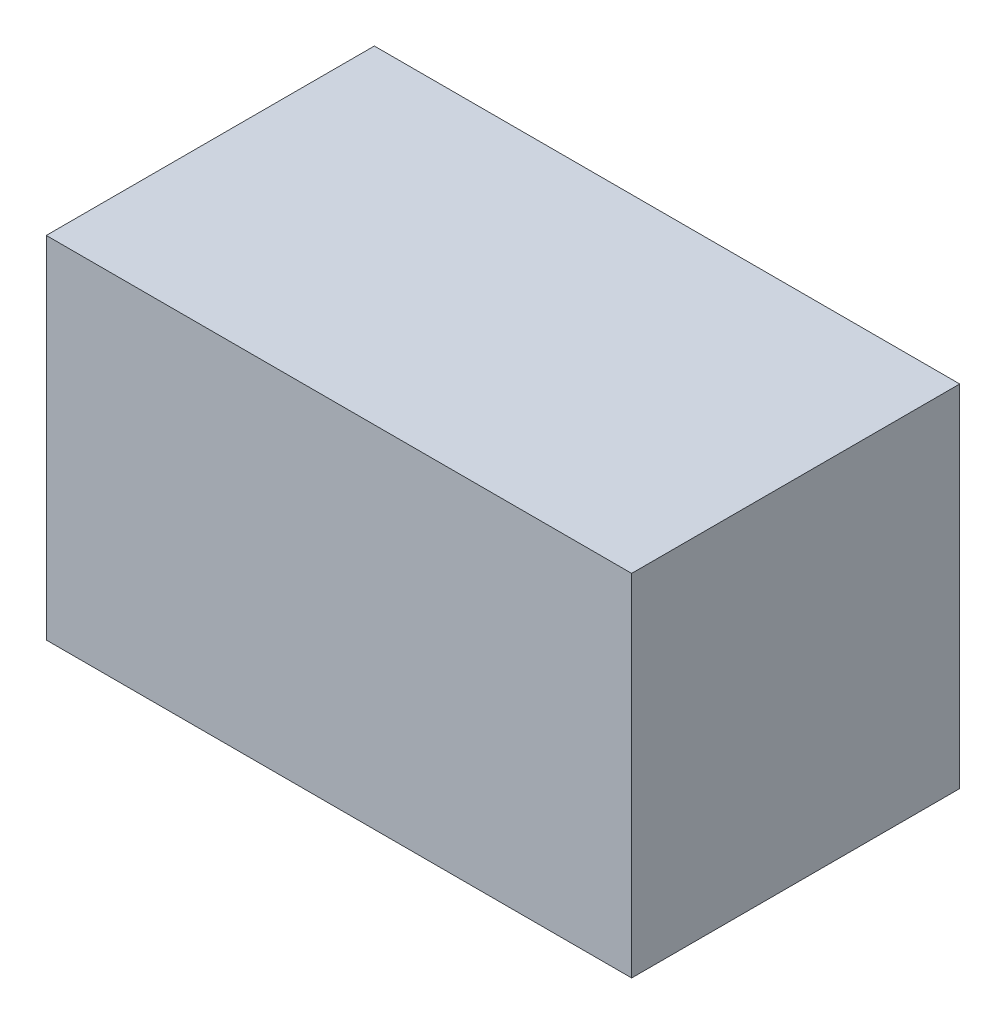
ISO-10303-21;
HEADER;
FILE_DESCRIPTION(('STEP AP214'),'2;1');
FILE_NAME('part.step','',(''),(''),'','','');
FILE_SCHEMA(('AUTOMOTIVE_DESIGN { 1 0 10303 214 1 1 1 1 }'));
ENDSEC;
DATA;
#1=APPLICATION_CONTEXT('core data for automotive mechanical design processes');
#2=APPLICATION_PROTOCOL_DEFINITION('international standard','automotive_design',2000,#1);
#3=PRODUCT_CONTEXT('',#1,'mechanical');
#4=PRODUCT('Part','Part','',(#3));
#5=PRODUCT_RELATED_PRODUCT_CATEGORY('part','',(#4));
#6=PRODUCT_DEFINITION_FORMATION('','',#4);
#7=PRODUCT_DEFINITION_CONTEXT('part definition',#1,'design');
#8=PRODUCT_DEFINITION('design','',#6,#7);
#9=PRODUCT_DEFINITION_SHAPE('','',#8);
#10=(LENGTH_UNIT() NAMED_UNIT(*) SI_UNIT(.MILLI.,.METRE.));
#11=(NAMED_UNIT(*) PLANE_ANGLE_UNIT() SI_UNIT($,.RADIAN.));
#12=(NAMED_UNIT(*) SI_UNIT($,.STERADIAN.) SOLID_ANGLE_UNIT());
#13=UNCERTAINTY_MEASURE_WITH_UNIT(LENGTH_MEASURE(1.E-05),#10,'distance_accuracy_value','');
#14=(GEOMETRIC_REPRESENTATION_CONTEXT(3) GLOBAL_UNCERTAINTY_ASSIGNED_CONTEXT((#13)) GLOBAL_UNIT_ASSIGNED_CONTEXT((#10,
#11,#12)) REPRESENTATION_CONTEXT('',''));
#15=CARTESIAN_POINT('',(0.,0.,0.));
#16=DIRECTION('',(0.,0.,1.));
#17=DIRECTION('',(1.,0.,0.));
#18=AXIS2_PLACEMENT_3D('',#15,#16,#17);
#19=CARTESIAN_POINT('',(109.686819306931,131.318,-61.4728327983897));
#20=DIRECTION('',(-1.,0.,0.));
#21=DIRECTION('',(0.,0.,1.));
#22=AXIS2_PLACEMENT_3D('',#19,#20,#21);
#23=PLANE('',#22);
#24=DIRECTION('',(0.,0.,-1.));
#25=VECTOR('',#24,1.);
#26=CARTESIAN_POINT('',(109.686819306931,0.,-61.4728327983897));
#27=LINE('',#26,#25);
#28=CARTESIAN_POINT('',(109.686819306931,0.,61.4728327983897));
#29=VERTEX_POINT('',#28);
#30=CARTESIAN_POINT('',(109.686819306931,0.,-61.4728327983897));
#31=VERTEX_POINT('',#30);
#32=EDGE_CURVE('E142',#29,#31,#27,.T.);
#33=ORIENTED_EDGE('',*,*,#32,.T.);
#34=DIRECTION('',(0.,-1.,0.));
#35=VECTOR('',#34,1.);
#36=CARTESIAN_POINT('',(109.686819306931,131.318,-61.4728327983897));
#37=LINE('',#36,#35);
#38=CARTESIAN_POINT('',(109.686819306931,131.318,-61.4728327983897));
#39=VERTEX_POINT('',#38);
#40=EDGE_CURVE('E133',#39,#31,#37,.T.);
#41=ORIENTED_EDGE('',*,*,#40,.F.);
#42=DIRECTION('',(0.,0.,-1.));
#43=VECTOR('',#42,1.);
#44=CARTESIAN_POINT('',(109.686819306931,131.318,-61.4728327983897));
#45=LINE('',#44,#43);
#46=CARTESIAN_POINT('',(109.686819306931,131.318,61.4728327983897));
#47=VERTEX_POINT('',#46);
#48=EDGE_CURVE('E127',#47,#39,#45,.T.);
#49=ORIENTED_EDGE('',*,*,#48,.F.);
#50=DIRECTION('',(0.,-1.,0.));
#51=VECTOR('',#50,1.);
#52=CARTESIAN_POINT('',(109.686819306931,131.318,61.4728327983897));
#53=LINE('',#52,#51);
#54=EDGE_CURVE('E138',#47,#29,#53,.T.);
#55=ORIENTED_EDGE('',*,*,#54,.T.);
#56=EDGE_LOOP('',(#33,#41,#49,#55));
#57=FACE_BOUND('',#56,.T.);
#58=ADVANCED_FACE('F36',(#57),#23,.F.);
#59=CARTESIAN_POINT('',(-109.686819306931,131.318,-61.4728327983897));
#60=DIRECTION('',(0.,0.,1.));
#61=DIRECTION('',(1.,0.,0.));
#62=AXIS2_PLACEMENT_3D('',#59,#60,#61);
#63=PLANE('',#62);
#64=DIRECTION('',(-1.,0.,0.));
#65=VECTOR('',#64,1.);
#66=CARTESIAN_POINT('',(-109.686819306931,0.,-61.4728327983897));
#67=LINE('',#66,#65);
#68=CARTESIAN_POINT('',(-109.686819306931,0.,-61.4728327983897));
#69=VERTEX_POINT('',#68);
#70=EDGE_CURVE('E132',#31,#69,#67,.T.);
#71=ORIENTED_EDGE('',*,*,#70,.T.);
#72=DIRECTION('',(0.,-1.,0.));
#73=VECTOR('',#72,1.);
#74=CARTESIAN_POINT('',(-109.686819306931,131.318,-61.4728327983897));
#75=LINE('',#74,#73);
#76=CARTESIAN_POINT('',(-109.686819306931,131.318,-61.4728327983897));
#77=VERTEX_POINT('',#76);
#78=EDGE_CURVE('E130',#77,#69,#75,.T.);
#79=ORIENTED_EDGE('',*,*,#78,.F.);
#80=DIRECTION('',(-1.,0.,0.));
#81=VECTOR('',#80,1.);
#82=CARTESIAN_POINT('',(-109.686819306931,131.318,-61.4728327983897));
#83=LINE('',#82,#81);
#84=EDGE_CURVE('E122',#39,#77,#83,.T.);
#85=ORIENTED_EDGE('',*,*,#84,.F.);
#86=ORIENTED_EDGE('',*,*,#40,.T.);
#87=EDGE_LOOP('',(#71,#79,#85,#86));
#88=FACE_BOUND('',#87,.T.);
#89=ADVANCED_FACE('F131',(#88),#63,.F.);
#90=CARTESIAN_POINT('',(-109.686819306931,131.318,-61.4728327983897));
#91=DIRECTION('',(1.,0.,0.));
#92=DIRECTION('',(0.,0.,-1.));
#93=AXIS2_PLACEMENT_3D('',#90,#91,#92);
#94=PLANE('',#93);
#95=DIRECTION('',(0.,0.,1.));
#96=VECTOR('',#95,1.);
#97=CARTESIAN_POINT('',(-109.686819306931,0.,-61.4728327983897));
#98=LINE('',#97,#96);
#99=CARTESIAN_POINT('',(-109.686819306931,0.,61.4728327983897));
#100=VERTEX_POINT('',#99);
#101=EDGE_CURVE('E108',#69,#100,#98,.T.);
#102=ORIENTED_EDGE('',*,*,#101,.T.);
#103=DIRECTION('',(0.,-1.,0.));
#104=VECTOR('',#103,1.);
#105=CARTESIAN_POINT('',(-109.686819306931,131.318,61.4728327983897));
#106=LINE('',#105,#104);
#107=CARTESIAN_POINT('',(-109.686819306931,131.318,61.4728327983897));
#108=VERTEX_POINT('',#107);
#109=EDGE_CURVE('E134',#108,#100,#106,.T.);
#110=ORIENTED_EDGE('',*,*,#109,.F.);
#111=DIRECTION('',(0.,0.,1.));
#112=VECTOR('',#111,1.);
#113=CARTESIAN_POINT('',(-109.686819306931,131.318,-61.4728327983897));
#114=LINE('',#113,#112);
#115=EDGE_CURVE('E125',#77,#108,#114,.T.);
#116=ORIENTED_EDGE('',*,*,#115,.F.);
#117=ORIENTED_EDGE('',*,*,#78,.T.);
#118=EDGE_LOOP('',(#102,#110,#116,#117));
#119=FACE_BOUND('',#118,.T.);
#120=ADVANCED_FACE('F136',(#119),#94,.F.);
#121=CARTESIAN_POINT('',(-109.686819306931,131.318,61.4728327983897));
#122=DIRECTION('',(0.,0.,-1.));
#123=DIRECTION('',(-1.,0.,0.));
#124=AXIS2_PLACEMENT_3D('',#121,#122,#123);
#125=PLANE('',#124);
#126=DIRECTION('',(1.,0.,0.));
#127=VECTOR('',#126,1.);
#128=CARTESIAN_POINT('',(-109.686819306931,0.,61.4728327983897));
#129=LINE('',#128,#127);
#130=EDGE_CURVE('E114',#100,#29,#129,.T.);
#131=ORIENTED_EDGE('',*,*,#130,.T.);
#132=ORIENTED_EDGE('',*,*,#54,.F.);
#133=DIRECTION('',(1.,0.,0.));
#134=VECTOR('',#133,1.);
#135=CARTESIAN_POINT('',(-109.686819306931,131.318,61.4728327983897));
#136=LINE('',#135,#134);
#137=EDGE_CURVE('E91',#108,#47,#136,.T.);
#138=ORIENTED_EDGE('',*,*,#137,.F.);
#139=ORIENTED_EDGE('',*,*,#109,.T.);
#140=EDGE_LOOP('',(#131,#132,#138,#139));
#141=FACE_BOUND('',#140,.T.);
#142=ADVANCED_FACE('F206',(#141),#125,.F.);
#143=CARTESIAN_POINT('',(109.686819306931,131.318,61.4728327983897));
#144=DIRECTION('',(0.,1.,0.));
#145=DIRECTION('',(0.,0.,1.));
#146=AXIS2_PLACEMENT_3D('',#143,#144,#145);
#147=PLANE('',#146);
#148=ORIENTED_EDGE('',*,*,#48,.T.);
#149=ORIENTED_EDGE('',*,*,#84,.T.);
#150=ORIENTED_EDGE('',*,*,#115,.T.);
#151=ORIENTED_EDGE('',*,*,#137,.T.);
#152=EDGE_LOOP('',(#148,#149,#150,#151));
#153=FACE_BOUND('',#152,.T.);
#154=ADVANCED_FACE('F123',(#153),#147,.T.);
#155=CARTESIAN_POINT('',(109.686819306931,0.,61.4728327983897));
#156=DIRECTION('',(0.,1.,0.));
#157=DIRECTION('',(0.,0.,1.));
#158=AXIS2_PLACEMENT_3D('',#155,#156,#157);
#159=PLANE('',#158);
#160=ORIENTED_EDGE('',*,*,#32,.F.);
#161=ORIENTED_EDGE('',*,*,#130,.F.);
#162=ORIENTED_EDGE('',*,*,#101,.F.);
#163=ORIENTED_EDGE('',*,*,#70,.F.);
#164=EDGE_LOOP('',(#160,#161,#162,#163));
#165=FACE_BOUND('',#164,.T.);
#166=ADVANCED_FACE('F209',(#165),#159,.F.);
#167=CLOSED_SHELL('',(#58,#89,#120,#142,#154,#166));
#168=CARTESIAN_POINT('',(107.146819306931,131.318,-61.4728327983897));
#169=DIRECTION('',(-1.,0.,0.));
#170=DIRECTION('',(0.,0.,1.));
#171=AXIS2_PLACEMENT_3D('',#168,#169,#170);
#172=PLANE('',#171);
#173=DIRECTION('',(0.,0.,-1.));
#174=VECTOR('',#173,1.);
#175=CARTESIAN_POINT('',(107.146819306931,2.53999999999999,-61.4728327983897));
#176=LINE('',#175,#174);
#177=CARTESIAN_POINT('',(107.146819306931,2.54,58.9328327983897));
#178=VERTEX_POINT('',#177);
#179=CARTESIAN_POINT('',(107.146819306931,2.54,-58.9328327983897));
#180=VERTEX_POINT('',#179);
#181=EDGE_CURVE('E40',#178,#180,#176,.T.);
#182=ORIENTED_EDGE('',*,*,#181,.F.);
#183=DIRECTION('',(0.,-1.,0.));
#184=VECTOR('',#183,1.);
#185=CARTESIAN_POINT('',(107.146819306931,131.318,58.9328327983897));
#186=LINE('',#185,#184);
#187=CARTESIAN_POINT('',(107.146819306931,128.778,58.9328327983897));
#188=VERTEX_POINT('',#187);
#189=EDGE_CURVE('E166',#188,#178,#186,.T.);
#190=ORIENTED_EDGE('',*,*,#189,.F.);
#191=DIRECTION('',(0.,0.,-1.));
#192=VECTOR('',#191,1.);
#193=CARTESIAN_POINT('',(107.146819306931,128.778,-61.4728327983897));
#194=LINE('',#193,#192);
#195=CARTESIAN_POINT('',(107.146819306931,128.778,-58.9328327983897));
#196=VERTEX_POINT('',#195);
#197=EDGE_CURVE('E153',#188,#196,#194,.T.);
#198=ORIENTED_EDGE('',*,*,#197,.T.);
#199=DIRECTION('',(0.,-1.,0.));
#200=VECTOR('',#199,1.);
#201=CARTESIAN_POINT('',(107.146819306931,131.318,-58.9328327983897));
#202=LINE('',#201,#200);
#203=EDGE_CURVE('E164',#196,#180,#202,.T.);
#204=ORIENTED_EDGE('',*,*,#203,.T.);
#205=EDGE_LOOP('',(#182,#190,#198,#204));
#206=FACE_BOUND('',#205,.T.);
#207=ADVANCED_FACE('F173',(#206),#172,.T.);
#208=CARTESIAN_POINT('',(-109.686819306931,131.318,-58.9328327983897));
#209=DIRECTION('',(0.,0.,1.));
#210=DIRECTION('',(1.,0.,0.));
#211=AXIS2_PLACEMENT_3D('',#208,#209,#210);
#212=PLANE('',#211);
#213=DIRECTION('',(-1.,0.,0.));
#214=VECTOR('',#213,1.);
#215=CARTESIAN_POINT('',(-109.686819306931,2.53999999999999,-58.9328327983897));
#216=LINE('',#215,#214);
#217=CARTESIAN_POINT('',(-107.146819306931,2.54,-58.9328327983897));
#218=VERTEX_POINT('',#217);
#219=EDGE_CURVE('E56',#180,#218,#216,.T.);
#220=ORIENTED_EDGE('',*,*,#219,.F.);
#221=ORIENTED_EDGE('',*,*,#203,.F.);
#222=DIRECTION('',(-1.,0.,0.));
#223=VECTOR('',#222,1.);
#224=CARTESIAN_POINT('',(-109.686819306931,128.778,-58.9328327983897));
#225=LINE('',#224,#223);
#226=CARTESIAN_POINT('',(-107.146819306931,128.778,-58.9328327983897));
#227=VERTEX_POINT('',#226);
#228=EDGE_CURVE('E79',#196,#227,#225,.T.);
#229=ORIENTED_EDGE('',*,*,#228,.T.);
#230=DIRECTION('',(0.,-1.,0.));
#231=VECTOR('',#230,1.);
#232=CARTESIAN_POINT('',(-107.146819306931,131.318,-58.9328327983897));
#233=LINE('',#232,#231);
#234=EDGE_CURVE('E160',#227,#218,#233,.T.);
#235=ORIENTED_EDGE('',*,*,#234,.T.);
#236=EDGE_LOOP('',(#220,#221,#229,#235));
#237=FACE_BOUND('',#236,.T.);
#238=ADVANCED_FACE('F174',(#237),#212,.T.);
#239=CARTESIAN_POINT('',(-107.146819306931,131.318,-61.4728327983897));
#240=DIRECTION('',(1.,0.,0.));
#241=DIRECTION('',(0.,0.,-1.));
#242=AXIS2_PLACEMENT_3D('',#239,#240,#241);
#243=PLANE('',#242);
#244=DIRECTION('',(0.,0.,1.));
#245=VECTOR('',#244,1.);
#246=CARTESIAN_POINT('',(-107.146819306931,2.53999999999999,-61.4728327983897));
#247=LINE('',#246,#245);
#248=CARTESIAN_POINT('',(-107.146819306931,2.54,58.9328327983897));
#249=VERTEX_POINT('',#248);
#250=EDGE_CURVE('E162',#218,#249,#247,.T.);
#251=ORIENTED_EDGE('',*,*,#250,.F.);
#252=ORIENTED_EDGE('',*,*,#234,.F.);
#253=DIRECTION('',(0.,0.,1.));
#254=VECTOR('',#253,1.);
#255=CARTESIAN_POINT('',(-107.146819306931,128.778,-61.4728327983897));
#256=LINE('',#255,#254);
#257=CARTESIAN_POINT('',(-107.146819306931,128.778,58.9328327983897));
#258=VERTEX_POINT('',#257);
#259=EDGE_CURVE('E47',#227,#258,#256,.T.);
#260=ORIENTED_EDGE('',*,*,#259,.T.);
#261=DIRECTION('',(0.,-1.,0.));
#262=VECTOR('',#261,1.);
#263=CARTESIAN_POINT('',(-107.146819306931,131.318,58.9328327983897));
#264=LINE('',#263,#262);
#265=EDGE_CURVE('E155',#258,#249,#264,.T.);
#266=ORIENTED_EDGE('',*,*,#265,.T.);
#267=EDGE_LOOP('',(#251,#252,#260,#266));
#268=FACE_BOUND('',#267,.T.);
#269=ADVANCED_FACE('F178',(#268),#243,.T.);
#270=CARTESIAN_POINT('',(-109.686819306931,131.318,58.9328327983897));
#271=DIRECTION('',(0.,0.,-1.));
#272=DIRECTION('',(-1.,0.,0.));
#273=AXIS2_PLACEMENT_3D('',#270,#271,#272);
#274=PLANE('',#273);
#275=DIRECTION('',(1.,0.,0.));
#276=VECTOR('',#275,1.);
#277=CARTESIAN_POINT('',(-109.686819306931,2.53999999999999,58.9328327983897));
#278=LINE('',#277,#276);
#279=EDGE_CURVE('E158',#249,#178,#278,.T.);
#280=ORIENTED_EDGE('',*,*,#279,.F.);
#281=ORIENTED_EDGE('',*,*,#265,.F.);
#282=DIRECTION('',(1.,0.,0.));
#283=VECTOR('',#282,1.);
#284=CARTESIAN_POINT('',(-109.686819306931,128.778,58.9328327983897));
#285=LINE('',#284,#283);
#286=EDGE_CURVE('E11',#258,#188,#285,.T.);
#287=ORIENTED_EDGE('',*,*,#286,.T.);
#288=ORIENTED_EDGE('',*,*,#189,.T.);
#289=EDGE_LOOP('',(#280,#281,#287,#288));
#290=FACE_BOUND('',#289,.T.);
#291=ADVANCED_FACE('F182',(#290),#274,.T.);
#292=CARTESIAN_POINT('',(109.686819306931,128.778,61.4728327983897));
#293=DIRECTION('',(0.,1.,0.));
#294=DIRECTION('',(0.,0.,1.));
#295=AXIS2_PLACEMENT_3D('',#292,#293,#294);
#296=PLANE('',#295);
#297=ORIENTED_EDGE('',*,*,#197,.F.);
#298=ORIENTED_EDGE('',*,*,#286,.F.);
#299=ORIENTED_EDGE('',*,*,#259,.F.);
#300=ORIENTED_EDGE('',*,*,#228,.F.);
#301=EDGE_LOOP('',(#297,#298,#299,#300));
#302=FACE_BOUND('',#301,.T.);
#303=ADVANCED_FACE('F181',(#302),#296,.F.);
#304=CARTESIAN_POINT('',(109.686819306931,2.54,61.4728327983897));
#305=DIRECTION('',(0.,1.,0.));
#306=DIRECTION('',(0.,0.,1.));
#307=AXIS2_PLACEMENT_3D('',#304,#305,#306);
#308=PLANE('',#307);
#309=ORIENTED_EDGE('',*,*,#181,.T.);
#310=ORIENTED_EDGE('',*,*,#219,.T.);
#311=ORIENTED_EDGE('',*,*,#250,.T.);
#312=ORIENTED_EDGE('',*,*,#279,.T.);
#313=EDGE_LOOP('',(#309,#310,#311,#312));
#314=FACE_BOUND('',#313,.T.);
#315=ADVANCED_FACE('F38',(#314),#308,.T.);
#316=CLOSED_SHELL('',(#207,#238,#269,#291,#303,#315));
#317=ORIENTED_CLOSED_SHELL('',*,#316,.T.);
#318=BREP_WITH_VOIDS('B2',#167,(#317));
#319=ADVANCED_BREP_SHAPE_REPRESENTATION('',(#18,#318),#14);
#320=SHAPE_DEFINITION_REPRESENTATION(#9,#319);
ENDSEC;
END-ISO-10303-21;
